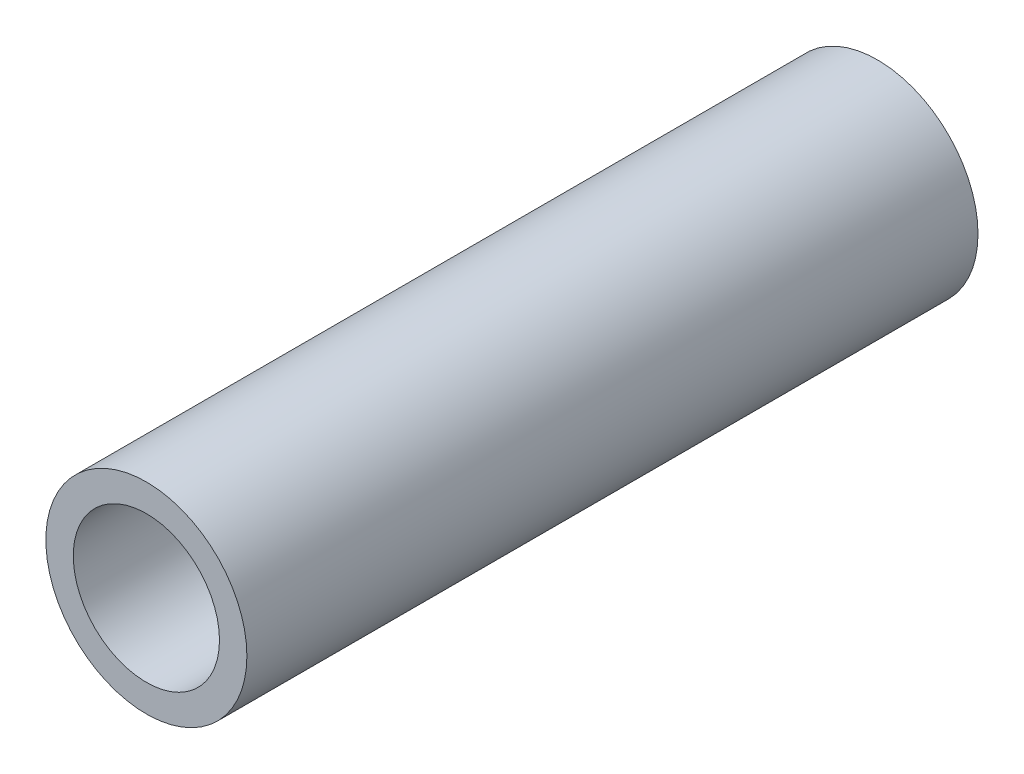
from build123d import *

# Parameters (mm, degrees)
SKETCH1_R          = 6.985
SKETCH1_R_2        = 5.08
BASE_EXTRUDE_DEPTH = 50.8


with BuildPart() as part:
    # Sketch1 → Base-Extrude (new body)
    with BuildSketch(Plane.XY):
        Circle(SKETCH1_R)
        Circle(SKETCH1_R_2, mode=Mode.SUBTRACT)
    extrude(amount=BASE_EXTRUDE_DEPTH)


solid = part.part
